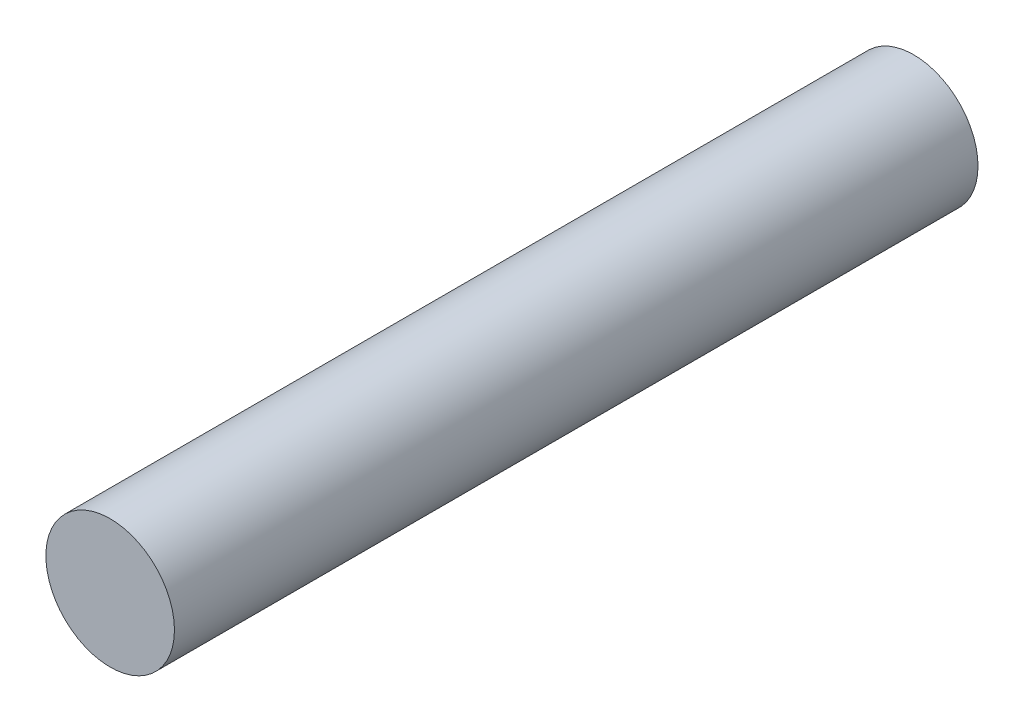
from build123d import *

# Parameters (mm, degrees)
SKETCH_1_R      = 4
EXTRUDE_1_DEPTH = 50


with BuildPart() as part:
    # Sketch 1 → Extrude 1 (new body)
    with BuildSketch(Plane.XY):
        Circle(SKETCH_1_R)
    extrude(amount=EXTRUDE_1_DEPTH)


solid = part.part
